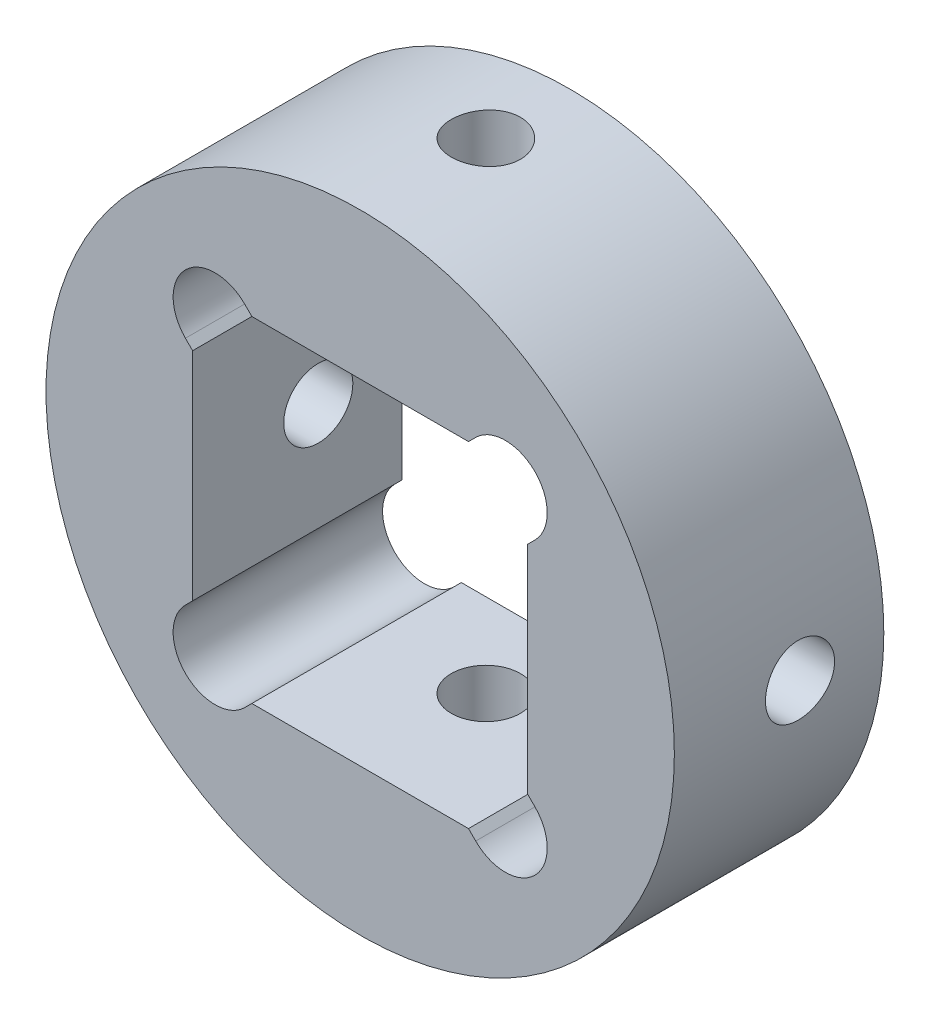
ISO-10303-21;
HEADER;
FILE_DESCRIPTION(('STEP AP214'),'2;1');
FILE_NAME('part.step','',(''),(''),'','','');
FILE_SCHEMA(('AUTOMOTIVE_DESIGN { 1 0 10303 214 1 1 1 1 }'));
ENDSEC;
DATA;
#1=APPLICATION_CONTEXT('core data for automotive mechanical design processes');
#2=APPLICATION_PROTOCOL_DEFINITION('international standard','automotive_design',2000,#1);
#3=PRODUCT_CONTEXT('',#1,'mechanical');
#4=PRODUCT('Part','Part','',(#3));
#5=PRODUCT_RELATED_PRODUCT_CATEGORY('part','',(#4));
#6=PRODUCT_DEFINITION_FORMATION('','',#4);
#7=PRODUCT_DEFINITION_CONTEXT('part definition',#1,'design');
#8=PRODUCT_DEFINITION('design','',#6,#7);
#9=PRODUCT_DEFINITION_SHAPE('','',#8);
#10=(LENGTH_UNIT() NAMED_UNIT(*) SI_UNIT(.MILLI.,.METRE.));
#11=(NAMED_UNIT(*) PLANE_ANGLE_UNIT() SI_UNIT($,.RADIAN.));
#12=(NAMED_UNIT(*) SI_UNIT($,.STERADIAN.) SOLID_ANGLE_UNIT());
#13=UNCERTAINTY_MEASURE_WITH_UNIT(LENGTH_MEASURE(1.E-05),#10,'distance_accuracy_value','');
#14=(GEOMETRIC_REPRESENTATION_CONTEXT(3) GLOBAL_UNCERTAINTY_ASSIGNED_CONTEXT((#13)) GLOBAL_UNIT_ASSIGNED_CONTEXT((#10,
#11,#12)) REPRESENTATION_CONTEXT('',''));
#15=CARTESIAN_POINT('',(0.,0.,0.));
#16=DIRECTION('',(0.,0.,1.));
#17=DIRECTION('',(1.,0.,0.));
#18=AXIS2_PLACEMENT_3D('',#15,#16,#17);
#19=CARTESIAN_POINT('',(0.,0.,6.));
#20=DIRECTION('',(0.,0.,1.));
#21=DIRECTION('',(1.,0.,0.));
#22=AXIS2_PLACEMENT_3D('',#19,#20,#21);
#23=PLANE('',#22);
#24=CARTESIAN_POINT('',(0.,0.,6.));
#25=DIRECTION('',(0.,0.,1.));
#26=DIRECTION('',(1.,0.,0.));
#27=AXIS2_PLACEMENT_3D('',#24,#25,#26);
#28=CIRCLE('',#27,15.);
#29=CARTESIAN_POINT('',(15.,0.,6.));
#30=VERTEX_POINT('',#29);
#31=EDGE_CURVE('E273',#30,#30,#28,.T.);
#32=ORIENTED_EDGE('',*,*,#31,.T.);
#33=EDGE_LOOP('',(#32));
#34=FACE_BOUND('',#33,.T.);
#35=DIRECTION('',(-0.707106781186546,-0.707106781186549,0.));
#36=VECTOR('',#35,1.);
#37=CARTESIAN_POINT('',(5.51543289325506,8.34386001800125,6.));
#38=LINE('',#37,#36);
#39=CARTESIAN_POINT('',(5.51543289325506,8.34386001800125,6.));
#40=VERTEX_POINT('',#39);
#41=CARTESIAN_POINT('',(5.17157287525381,8.,6.));
#42=VERTEX_POINT('',#41);
#43=EDGE_CURVE('E158',#40,#42,#38,.T.);
#44=ORIENTED_EDGE('',*,*,#43,.F.);
#45=CARTESIAN_POINT('',(6.92964645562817,6.92964645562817,6.));
#46=DIRECTION('',(0.,0.,1.));
#47=DIRECTION('',(1.,0.,0.));
#48=AXIS2_PLACEMENT_3D('',#45,#46,#47);
#49=CIRCLE('',#48,2.);
#50=CARTESIAN_POINT('',(8.34386001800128,5.51543289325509,6.));
#51=VERTEX_POINT('',#50);
#52=EDGE_CURVE('E150',#51,#40,#49,.T.);
#53=ORIENTED_EDGE('',*,*,#52,.F.);
#54=DIRECTION('',(0.707106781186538,0.707106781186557,0.));
#55=VECTOR('',#54,1.);
#56=CARTESIAN_POINT('',(8.34386001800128,5.51543289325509,6.));
#57=LINE('',#56,#55);
#58=CARTESIAN_POINT('',(8.,5.1715728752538,6.));
#59=VERTEX_POINT('',#58);
#60=EDGE_CURVE('E200',#59,#51,#57,.T.);
#61=ORIENTED_EDGE('',*,*,#60,.F.);
#62=DIRECTION('',(0.,1.,0.));
#63=VECTOR('',#62,1.);
#64=CARTESIAN_POINT('',(8.,5.1715728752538,6.));
#65=LINE('',#64,#63);
#66=CARTESIAN_POINT('',(7.99999999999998,-5.17157287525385,6.));
#67=VERTEX_POINT('',#66);
#68=EDGE_CURVE('E198',#67,#59,#65,.T.);
#69=ORIENTED_EDGE('',*,*,#68,.F.);
#70=DIRECTION('',(-0.707106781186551,0.707106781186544,0.));
#71=VECTOR('',#70,1.);
#72=CARTESIAN_POINT('',(8.34386001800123,-5.51543289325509,6.));
#73=LINE('',#72,#71);
#74=CARTESIAN_POINT('',(8.34386001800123,-5.51543289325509,6.));
#75=VERTEX_POINT('',#74);
#76=EDGE_CURVE('E196',#75,#67,#73,.T.);
#77=ORIENTED_EDGE('',*,*,#76,.F.);
#78=CARTESIAN_POINT('',(6.92964645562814,-6.92964645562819,6.));
#79=DIRECTION('',(0.,0.,1.));
#80=DIRECTION('',(1.,0.,0.));
#81=AXIS2_PLACEMENT_3D('',#78,#79,#80);
#82=CIRCLE('',#81,2.);
#83=CARTESIAN_POINT('',(5.51543289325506,-8.3438600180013,6.));
#84=VERTEX_POINT('',#83);
#85=EDGE_CURVE('E194',#84,#75,#82,.T.);
#86=ORIENTED_EDGE('',*,*,#85,.F.);
#87=DIRECTION('',(0.707106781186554,-0.707106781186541,0.));
#88=VECTOR('',#87,1.);
#89=CARTESIAN_POINT('',(5.51543289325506,-8.3438600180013,6.));
#90=LINE('',#89,#88);
#91=CARTESIAN_POINT('',(5.17157287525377,-8.00000000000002,6.));
#92=VERTEX_POINT('',#91);
#93=EDGE_CURVE('E192',#92,#84,#90,.T.);
#94=ORIENTED_EDGE('',*,*,#93,.F.);
#95=DIRECTION('',(1.,0.,0.));
#96=VECTOR('',#95,1.);
#97=CARTESIAN_POINT('',(-5.17157287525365,-8.,6.));
#98=LINE('',#97,#96);
#99=CARTESIAN_POINT('',(-5.17157287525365,-8.,6.));
#100=VERTEX_POINT('',#99);
#101=EDGE_CURVE('E190',#100,#92,#98,.T.);
#102=ORIENTED_EDGE('',*,*,#101,.F.);
#103=DIRECTION('',(0.707106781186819,0.707106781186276,0.));
#104=VECTOR('',#103,1.);
#105=CARTESIAN_POINT('',(-5.51543289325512,-8.34386001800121,6.));
#106=LINE('',#105,#104);
#107=CARTESIAN_POINT('',(-5.51543289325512,-8.34386001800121,6.));
#108=VERTEX_POINT('',#107);
#109=EDGE_CURVE('E188',#108,#100,#106,.T.);
#110=ORIENTED_EDGE('',*,*,#109,.F.);
#111=CARTESIAN_POINT('',(-6.92964645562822,-6.92964645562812,6.));
#112=DIRECTION('',(0.,0.,1.));
#113=DIRECTION('',(1.,0.,0.));
#114=AXIS2_PLACEMENT_3D('',#111,#112,#113);
#115=CIRCLE('',#114,2.);
#116=CARTESIAN_POINT('',(-8.34386001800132,-5.51543289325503,6.));
#117=VERTEX_POINT('',#116);
#118=EDGE_CURVE('E186',#117,#108,#115,.T.);
#119=ORIENTED_EDGE('',*,*,#118,.F.);
#120=DIRECTION('',(-0.707106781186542,-0.707106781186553,0.));
#121=VECTOR('',#120,1.);
#122=CARTESIAN_POINT('',(-8.34386001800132,-5.51543289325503,6.));
#123=LINE('',#122,#121);
#124=CARTESIAN_POINT('',(-8.00000000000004,-5.17157287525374,6.));
#125=VERTEX_POINT('',#124);
#126=EDGE_CURVE('E184',#125,#117,#123,.T.);
#127=ORIENTED_EDGE('',*,*,#126,.F.);
#128=DIRECTION('',(0.,-1.,0.));
#129=VECTOR('',#128,1.);
#130=CARTESIAN_POINT('',(-7.99999999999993,5.17157287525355,6.));
#131=LINE('',#130,#129);
#132=CARTESIAN_POINT('',(-7.99999999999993,5.17157287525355,6.));
#133=VERTEX_POINT('',#132);
#134=EDGE_CURVE('E182',#133,#125,#131,.T.);
#135=ORIENTED_EDGE('',*,*,#134,.F.);
#136=DIRECTION('',(0.707106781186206,-0.707106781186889,0.));
#137=VECTOR('',#136,1.);
#138=CARTESIAN_POINT('',(-8.3438600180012,5.51543289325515,6.));
#139=LINE('',#138,#137);
#140=CARTESIAN_POINT('',(-8.3438600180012,5.51543289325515,6.));
#141=VERTEX_POINT('',#140);
#142=EDGE_CURVE('E180',#141,#133,#139,.T.);
#143=ORIENTED_EDGE('',*,*,#142,.F.);
#144=CARTESIAN_POINT('',(-6.92964645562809,6.92964645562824,6.));
#145=DIRECTION('',(0.,0.,1.));
#146=DIRECTION('',(1.,0.,0.));
#147=AXIS2_PLACEMENT_3D('',#144,#145,#146);
#148=CIRCLE('',#147,2.);
#149=CARTESIAN_POINT('',(-5.51543289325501,8.34386001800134,6.));
#150=VERTEX_POINT('',#149);
#151=EDGE_CURVE('E178',#150,#141,#148,.T.);
#152=ORIENTED_EDGE('',*,*,#151,.F.);
#153=DIRECTION('',(-0.70710678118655,0.707106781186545,0.));
#154=VECTOR('',#153,1.);
#155=CARTESIAN_POINT('',(-5.51543289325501,8.34386001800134,6.));
#156=LINE('',#155,#154);
#157=CARTESIAN_POINT('',(-5.17157287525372,8.00000000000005,6.));
#158=VERTEX_POINT('',#157);
#159=EDGE_CURVE('E173',#158,#150,#156,.T.);
#160=ORIENTED_EDGE('',*,*,#159,.F.);
#161=DIRECTION('',(-1.,0.,0.));
#162=VECTOR('',#161,1.);
#163=CARTESIAN_POINT('',(-5.17157287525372,8.00000000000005,6.));
#164=LINE('',#163,#162);
#165=EDGE_CURVE('E171',#42,#158,#164,.T.);
#166=ORIENTED_EDGE('',*,*,#165,.F.);
#167=EDGE_LOOP('',(#44,#53,#61,#69,#77,#86,#94,#102,#110,#119,#127,#135,#143,#152,#160,#166));
#168=FACE_BOUND('',#167,.T.);
#169=ADVANCED_FACE('F33',(#34,#168),#23,.T.);
#170=CARTESIAN_POINT('',(0.,0.,-4.));
#171=DIRECTION('',(0.,0.,1.));
#172=DIRECTION('',(1.,0.,0.));
#173=AXIS2_PLACEMENT_3D('',#170,#171,#172);
#174=PLANE('',#173);
#175=CARTESIAN_POINT('',(0.,0.,-4.));
#176=DIRECTION('',(0.,0.,1.));
#177=DIRECTION('',(1.,0.,0.));
#178=AXIS2_PLACEMENT_3D('',#175,#176,#177);
#179=CIRCLE('',#178,15.);
#180=CARTESIAN_POINT('',(15.,0.,-4.));
#181=VERTEX_POINT('',#180);
#182=EDGE_CURVE('E166',#181,#181,#179,.T.);
#183=ORIENTED_EDGE('',*,*,#182,.F.);
#184=EDGE_LOOP('',(#183));
#185=FACE_BOUND('',#184,.T.);
#186=CARTESIAN_POINT('',(6.92964645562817,6.92964645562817,-4.));
#187=DIRECTION('',(0.,0.,1.));
#188=DIRECTION('',(1.,0.,0.));
#189=AXIS2_PLACEMENT_3D('',#186,#187,#188);
#190=CIRCLE('',#189,2.);
#191=CARTESIAN_POINT('',(8.34386001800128,5.51543289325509,-4.));
#192=VERTEX_POINT('',#191);
#193=CARTESIAN_POINT('',(5.51543289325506,8.34386001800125,-4.));
#194=VERTEX_POINT('',#193);
#195=EDGE_CURVE('E60',#192,#194,#190,.T.);
#196=ORIENTED_EDGE('',*,*,#195,.T.);
#197=DIRECTION('',(-0.707106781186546,-0.707106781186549,0.));
#198=VECTOR('',#197,1.);
#199=CARTESIAN_POINT('',(5.51543289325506,8.34386001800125,-4.));
#200=LINE('',#199,#198);
#201=CARTESIAN_POINT('',(5.17157287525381,8.,-4.));
#202=VERTEX_POINT('',#201);
#203=EDGE_CURVE('E165',#194,#202,#200,.T.);
#204=ORIENTED_EDGE('',*,*,#203,.T.);
#205=DIRECTION('',(-1.,0.,0.));
#206=VECTOR('',#205,1.);
#207=CARTESIAN_POINT('',(-5.17157287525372,8.00000000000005,-4.));
#208=LINE('',#207,#206);
#209=CARTESIAN_POINT('',(-5.17157287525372,8.00000000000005,-4.));
#210=VERTEX_POINT('',#209);
#211=EDGE_CURVE('E205',#202,#210,#208,.T.);
#212=ORIENTED_EDGE('',*,*,#211,.T.);
#213=DIRECTION('',(-0.70710678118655,0.707106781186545,0.));
#214=VECTOR('',#213,1.);
#215=CARTESIAN_POINT('',(-5.51543289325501,8.34386001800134,-4.));
#216=LINE('',#215,#214);
#217=CARTESIAN_POINT('',(-5.51543289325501,8.34386001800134,-4.));
#218=VERTEX_POINT('',#217);
#219=EDGE_CURVE('E208',#210,#218,#216,.T.);
#220=ORIENTED_EDGE('',*,*,#219,.T.);
#221=CARTESIAN_POINT('',(-6.92964645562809,6.92964645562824,-4.));
#222=DIRECTION('',(0.,0.,1.));
#223=DIRECTION('',(1.,0.,0.));
#224=AXIS2_PLACEMENT_3D('',#221,#222,#223);
#225=CIRCLE('',#224,2.);
#226=CARTESIAN_POINT('',(-8.3438600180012,5.51543289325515,-4.));
#227=VERTEX_POINT('',#226);
#228=EDGE_CURVE('E211',#218,#227,#225,.T.);
#229=ORIENTED_EDGE('',*,*,#228,.T.);
#230=DIRECTION('',(0.707106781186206,-0.707106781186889,0.));
#231=VECTOR('',#230,1.);
#232=CARTESIAN_POINT('',(-8.3438600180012,5.51543289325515,-4.));
#233=LINE('',#232,#231);
#234=CARTESIAN_POINT('',(-7.99999999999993,5.17157287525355,-4.));
#235=VERTEX_POINT('',#234);
#236=EDGE_CURVE('E214',#227,#235,#233,.T.);
#237=ORIENTED_EDGE('',*,*,#236,.T.);
#238=DIRECTION('',(0.,-1.,0.));
#239=VECTOR('',#238,1.);
#240=CARTESIAN_POINT('',(-7.99999999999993,5.17157287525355,-4.));
#241=LINE('',#240,#239);
#242=CARTESIAN_POINT('',(-8.00000000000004,-5.17157287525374,-4.));
#243=VERTEX_POINT('',#242);
#244=EDGE_CURVE('E217',#235,#243,#241,.T.);
#245=ORIENTED_EDGE('',*,*,#244,.T.);
#246=DIRECTION('',(-0.707106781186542,-0.707106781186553,0.));
#247=VECTOR('',#246,1.);
#248=CARTESIAN_POINT('',(-8.34386001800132,-5.51543289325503,-4.));
#249=LINE('',#248,#247);
#250=CARTESIAN_POINT('',(-8.34386001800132,-5.51543289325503,-4.));
#251=VERTEX_POINT('',#250);
#252=EDGE_CURVE('E220',#243,#251,#249,.T.);
#253=ORIENTED_EDGE('',*,*,#252,.T.);
#254=CARTESIAN_POINT('',(-6.92964645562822,-6.92964645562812,-4.));
#255=DIRECTION('',(0.,0.,1.));
#256=DIRECTION('',(1.,0.,0.));
#257=AXIS2_PLACEMENT_3D('',#254,#255,#256);
#258=CIRCLE('',#257,2.);
#259=CARTESIAN_POINT('',(-5.51543289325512,-8.34386001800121,-4.));
#260=VERTEX_POINT('',#259);
#261=EDGE_CURVE('E223',#251,#260,#258,.T.);
#262=ORIENTED_EDGE('',*,*,#261,.T.);
#263=DIRECTION('',(0.707106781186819,0.707106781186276,0.));
#264=VECTOR('',#263,1.);
#265=CARTESIAN_POINT('',(-5.51543289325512,-8.34386001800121,-4.));
#266=LINE('',#265,#264);
#267=CARTESIAN_POINT('',(-5.17157287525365,-8.,-4.));
#268=VERTEX_POINT('',#267);
#269=EDGE_CURVE('E226',#260,#268,#266,.T.);
#270=ORIENTED_EDGE('',*,*,#269,.T.);
#271=DIRECTION('',(1.,0.,0.));
#272=VECTOR('',#271,1.);
#273=CARTESIAN_POINT('',(-5.17157287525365,-8.,-4.));
#274=LINE('',#273,#272);
#275=CARTESIAN_POINT('',(5.17157287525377,-8.00000000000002,-4.));
#276=VERTEX_POINT('',#275);
#277=EDGE_CURVE('E229',#268,#276,#274,.T.);
#278=ORIENTED_EDGE('',*,*,#277,.T.);
#279=DIRECTION('',(0.707106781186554,-0.707106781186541,0.));
#280=VECTOR('',#279,1.);
#281=CARTESIAN_POINT('',(5.51543289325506,-8.3438600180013,-4.));
#282=LINE('',#281,#280);
#283=CARTESIAN_POINT('',(5.51543289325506,-8.3438600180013,-4.));
#284=VERTEX_POINT('',#283);
#285=EDGE_CURVE('E232',#276,#284,#282,.T.);
#286=ORIENTED_EDGE('',*,*,#285,.T.);
#287=CARTESIAN_POINT('',(6.92964645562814,-6.92964645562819,-4.));
#288=DIRECTION('',(0.,0.,1.));
#289=DIRECTION('',(1.,0.,0.));
#290=AXIS2_PLACEMENT_3D('',#287,#288,#289);
#291=CIRCLE('',#290,2.);
#292=CARTESIAN_POINT('',(8.34386001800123,-5.51543289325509,-4.));
#293=VERTEX_POINT('',#292);
#294=EDGE_CURVE('E235',#284,#293,#291,.T.);
#295=ORIENTED_EDGE('',*,*,#294,.T.);
#296=DIRECTION('',(-0.707106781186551,0.707106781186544,0.));
#297=VECTOR('',#296,1.);
#298=CARTESIAN_POINT('',(8.34386001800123,-5.51543289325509,-4.));
#299=LINE('',#298,#297);
#300=CARTESIAN_POINT('',(7.99999999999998,-5.17157287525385,-4.));
#301=VERTEX_POINT('',#300);
#302=EDGE_CURVE('E238',#293,#301,#299,.T.);
#303=ORIENTED_EDGE('',*,*,#302,.T.);
#304=DIRECTION('',(0.,1.,0.));
#305=VECTOR('',#304,1.);
#306=CARTESIAN_POINT('',(8.,5.1715728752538,-4.));
#307=LINE('',#306,#305);
#308=CARTESIAN_POINT('',(8.,5.1715728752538,-4.));
#309=VERTEX_POINT('',#308);
#310=EDGE_CURVE('E241',#301,#309,#307,.T.);
#311=ORIENTED_EDGE('',*,*,#310,.T.);
#312=DIRECTION('',(0.707106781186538,0.707106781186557,0.));
#313=VECTOR('',#312,1.);
#314=CARTESIAN_POINT('',(8.34386001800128,5.51543289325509,-4.));
#315=LINE('',#314,#313);
#316=EDGE_CURVE('E159',#309,#192,#315,.T.);
#317=ORIENTED_EDGE('',*,*,#316,.T.);
#318=EDGE_LOOP('',(#196,#204,#212,#220,#229,#237,#245,#253,#262,#270,#278,#286,#295,#303,#311,#317));
#319=FACE_BOUND('',#318,.T.);
#320=ADVANCED_FACE('F356',(#185,#319),#174,.F.);
#321=CARTESIAN_POINT('',(0.,0.,6.));
#322=DIRECTION('',(0.,0.,-1.));
#323=DIRECTION('',(-1.,0.,0.));
#324=AXIS2_PLACEMENT_3D('',#321,#322,#323);
#325=CYLINDRICAL_SURFACE('',#324,15.);
#326=CARTESIAN_POINT('',(15.,0.,1.64999999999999));
#327=CARTESIAN_POINT('',(14.9999988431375,0.0923818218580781,1.64999602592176));
#328=CARTESIAN_POINT('',(14.9991375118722,0.184823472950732,1.64221531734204));
#329=CARTESIAN_POINT('',(14.9957843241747,0.367140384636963,1.61129600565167));
#330=CARTESIAN_POINT('',(14.9932907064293,0.457012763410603,1.58814081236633));
#331=CARTESIAN_POINT('',(14.9869542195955,0.631524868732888,1.52715786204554));
#332=CARTESIAN_POINT('',(14.9831122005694,0.716167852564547,1.48933934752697));
#333=CARTESIAN_POINT('',(14.9745076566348,0.877887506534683,1.40012210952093));
#334=CARTESIAN_POINT('',(14.9697453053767,0.954965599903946,1.34872594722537));
#335=CARTESIAN_POINT('',(14.9598099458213,1.09971749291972,1.23357486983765));
#336=CARTESIAN_POINT('',(14.9546354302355,1.16735402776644,1.16977323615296));
#337=CARTESIAN_POINT('',(14.9444712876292,1.29098229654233,1.03172228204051));
#338=CARTESIAN_POINT('',(14.9394816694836,1.34697347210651,0.957472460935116));
#339=CARTESIAN_POINT('',(14.9302371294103,1.44585644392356,0.800395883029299));
#340=CARTESIAN_POINT('',(14.9259841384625,1.4887140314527,0.717547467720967));
#341=CARTESIAN_POINT('',(14.9187136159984,1.55989482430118,0.545775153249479));
#342=CARTESIAN_POINT('',(14.9156960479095,1.58821845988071,0.456851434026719));
#343=CARTESIAN_POINT('',(14.9112520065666,1.62941572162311,0.275835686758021));
#344=CARTESIAN_POINT('',(14.9098191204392,1.64235163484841,0.183757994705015));
#345=CARTESIAN_POINT('',(14.9086868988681,1.65259886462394,-0.00127181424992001));
#346=CARTESIAN_POINT('',(14.908987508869,1.64991067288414,-0.0942239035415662));
#347=CARTESIAN_POINT('',(14.9112824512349,1.62903725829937,-0.27793281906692));
#348=CARTESIAN_POINT('',(14.9132693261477,1.61092026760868,-0.368697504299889));
#349=CARTESIAN_POINT('',(14.9187012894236,1.55980980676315,-0.545890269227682));
#350=CARTESIAN_POINT('',(14.9221464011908,1.52681609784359,-0.632318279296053));
#351=CARTESIAN_POINT('',(14.9301152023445,1.44681419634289,-0.798598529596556));
#352=CARTESIAN_POINT('',(14.9346411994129,1.39977596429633,-0.878436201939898));
#353=CARTESIAN_POINT('',(14.944259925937,1.29304180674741,-1.02910998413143));
#354=CARTESIAN_POINT('',(14.9493526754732,1.23334543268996,-1.0999457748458));
#355=CARTESIAN_POINT('',(14.9595642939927,1.10260955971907,-1.23100135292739));
#356=CARTESIAN_POINT('',(14.9646831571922,1.03151117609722,-1.291162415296));
#357=CARTESIAN_POINT('',(14.9743446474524,0.88019332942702,-1.39870484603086));
#358=CARTESIAN_POINT('',(14.978887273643,0.799973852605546,-1.446086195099));
#359=CARTESIAN_POINT('',(14.9868864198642,0.632648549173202,-1.52672275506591));
#360=CARTESIAN_POINT('',(14.9903426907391,0.545541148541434,-1.55997472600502));
#361=CARTESIAN_POINT('',(14.9957772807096,0.3669329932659,-1.61136425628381));
#362=CARTESIAN_POINT('',(14.9977556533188,0.275432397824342,-1.62950236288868));
#363=CARTESIAN_POINT('',(15.0000046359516,0.0911434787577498,-1.65007418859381));
#364=CARTESIAN_POINT('',(15.0002840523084,-0.00163570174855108,-1.65258889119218));
#365=CARTESIAN_POINT('',(14.9991273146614,-0.186294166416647,-1.64205560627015));
#366=CARTESIAN_POINT('',(14.9976911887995,-0.278173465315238,-1.62900787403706));
#367=CARTESIAN_POINT('',(14.9932703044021,-0.458188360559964,-1.58778731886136));
#368=CARTESIAN_POINT('',(14.9902894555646,-0.546332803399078,-1.5596526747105));
#369=CARTESIAN_POINT('',(14.9831132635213,-0.716651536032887,-1.48909634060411));
#370=CARTESIAN_POINT('',(14.9789178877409,-0.798825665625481,-1.44667426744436));
#371=CARTESIAN_POINT('',(14.9697593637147,-0.955235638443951,-1.34854827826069));
#372=CARTESIAN_POINT('',(14.9647931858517,-1.02943811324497,-1.2927914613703));
#373=CARTESIAN_POINT('',(14.9546593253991,-1.16746002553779,-1.16965418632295));
#374=CARTESIAN_POINT('',(14.9494916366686,-1.23127914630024,-1.10227337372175));
#375=CARTESIAN_POINT('',(14.9395104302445,-1.34700625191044,-0.957446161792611));
#376=CARTESIAN_POINT('',(14.9346985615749,-1.39886088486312,-0.879957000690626));
#377=CARTESIAN_POINT('',(14.9259997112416,-1.48881961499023,-0.717322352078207));
#378=CARTESIAN_POINT('',(14.9221127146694,-1.52692393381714,-0.632176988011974));
#379=CARTESIAN_POINT('',(14.9157144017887,-1.58821216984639,-0.456825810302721));
#380=CARTESIAN_POINT('',(14.913200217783,-1.61142720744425,-0.366630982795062));
#381=CARTESIAN_POINT('',(14.9098235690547,-1.64237859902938,-0.183594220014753));
#382=CARTESIAN_POINT('',(14.9089610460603,-1.65011549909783,-0.0907523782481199));
#383=CARTESIAN_POINT('',(14.9089867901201,-1.64988250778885,0.0944125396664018));
#384=CARTESIAN_POINT('',(14.9098657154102,-1.64199642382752,0.186735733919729));
#385=CARTESIAN_POINT('',(14.9132553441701,-1.61091769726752,0.368736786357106));
#386=CARTESIAN_POINT('',(14.9157660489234,-1.58772504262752,0.45841464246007));
#387=CARTESIAN_POINT('',(14.9221336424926,-1.52671583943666,0.632574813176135));
#388=CARTESIAN_POINT('',(14.9259902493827,-1.48890235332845,0.717058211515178));
#389=CARTESIAN_POINT('',(14.9346156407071,-1.39973329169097,0.878493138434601));
#390=CARTESIAN_POINT('',(14.9393844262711,-1.3483776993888,0.955444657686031));
#391=CARTESIAN_POINT('',(14.9493275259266,-1.23326864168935,1.1000607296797));
#392=CARTESIAN_POINT('',(14.9545038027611,-1.16945266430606,1.16767539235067));
#393=CARTESIAN_POINT('',(14.9646609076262,-1.03136150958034,1.29127092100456));
#394=CARTESIAN_POINT('',(14.969641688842,-0.957083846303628,1.34724901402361));
#395=CARTESIAN_POINT('',(14.9788625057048,-0.799929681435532,1.44611876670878));
#396=CARTESIAN_POINT('',(14.9831002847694,-0.71702816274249,1.48897084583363));
#397=CARTESIAN_POINT('',(14.9903338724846,-0.545209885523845,1.56008722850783));
#398=CARTESIAN_POINT('',(14.993331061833,-0.456299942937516,1.58836775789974));
#399=CARTESIAN_POINT('',(14.9970040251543,-0.305751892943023,1.62259125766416));
#400=CARTESIAN_POINT('',(14.9981221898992,-0.245071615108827,1.6328552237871));
#401=CARTESIAN_POINT('',(14.9996205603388,-0.1229363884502,1.64656089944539));
#402=CARTESIAN_POINT('',(15.0000007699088,-0.0614814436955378,1.65000264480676));
#403=CARTESIAN_POINT('',(15.,0.,1.64999999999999));
#404=B_SPLINE_CURVE_WITH_KNOTS('',3,(#326,#327,#328,#329,#330,#331,#332,#333,#334,#335,#336,
#337,#338,#339,#340,#341,#342,#343,#344,#345,#346,#347,#348,#349,#350,#351,#352,#353,#354,#355,
#356,#357,#358,#359,#360,#361,#362,#363,#364,#365,#366,#367,#368,#369,#370,#371,#372,#373,#374,
#375,#376,#377,#378,#379,#380,#381,#382,#383,#384,#385,#386,#387,#388,#389,#390,#391,#392,#393,
#394,#395,#396,#397,#398,#399,#400,#401,#402,#403),.UNSPECIFIED.,.T.,.F.,(4,2,2,2,2,2,2,2,2,2,2,
2,2,2,2,2,2,2,2,2,2,2,2,2,2,2,2,2,2,2,2,2,2,2,2,2,2,2,4),(0.,0.276920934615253,
0.554141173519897,0.831186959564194,1.10818052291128,1.38623817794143,1.66430916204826,
1.94309839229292,2.22187936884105,2.49952800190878,2.77716789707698,3.05358629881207,
3.33000913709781,3.6070274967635,3.88405567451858,4.16256356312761,4.44107187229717,
4.71964401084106,4.99820606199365,5.27532298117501,5.55243535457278,5.82884975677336,
6.1052715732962,6.38280873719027,6.6603543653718,6.93911468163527,7.21787050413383,
7.49604177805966,7.77420323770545,8.05087657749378,8.3275501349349,8.60416577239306,
8.88078175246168,9.15882288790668,9.4369302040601,9.71586805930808,9.99449463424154,
10.1787905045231,10.3630854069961),.UNSPECIFIED.);
#405=CARTESIAN_POINT('',(15.,0.,1.64999999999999));
#406=VERTEX_POINT('',#405);
#407=EDGE_CURVE('E11',#406,#406,#404,.T.);
#408=ORIENTED_EDGE('',*,*,#407,.T.);
#409=EDGE_LOOP('',(#408));
#410=FACE_BOUND('',#409,.T.);
#411=CARTESIAN_POINT('',(0.,15.,-1.64999999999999));
#412=CARTESIAN_POINT('',(0.092381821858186,14.9999988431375,-1.64999602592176));
#413=CARTESIAN_POINT('',(0.18482347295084,14.9991375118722,-1.64221531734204));
#414=CARTESIAN_POINT('',(0.367140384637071,14.9957843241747,-1.61129600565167));
#415=CARTESIAN_POINT('',(0.457012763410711,14.9932907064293,-1.58814081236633));
#416=CARTESIAN_POINT('',(0.631524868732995,14.9869542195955,-1.52715786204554));
#417=CARTESIAN_POINT('',(0.716167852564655,14.9831122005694,-1.48933934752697));
#418=CARTESIAN_POINT('',(0.87788750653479,14.9745076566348,-1.40012210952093));
#419=CARTESIAN_POINT('',(0.954965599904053,14.9697453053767,-1.34872594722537));
#420=CARTESIAN_POINT('',(1.09971749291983,14.9598099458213,-1.23357486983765));
#421=CARTESIAN_POINT('',(1.16735402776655,14.9546354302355,-1.16977323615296));
#422=CARTESIAN_POINT('',(1.29098229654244,14.9444712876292,-1.03172228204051));
#423=CARTESIAN_POINT('',(1.34697347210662,14.9394816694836,-0.957472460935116));
#424=CARTESIAN_POINT('',(1.44585644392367,14.9302371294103,-0.800395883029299));
#425=CARTESIAN_POINT('',(1.48871403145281,14.9259841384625,-0.717547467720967));
#426=CARTESIAN_POINT('',(1.55989482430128,14.9187136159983,-0.545775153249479));
#427=CARTESIAN_POINT('',(1.58821845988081,14.9156960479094,-0.456851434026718));
#428=CARTESIAN_POINT('',(1.62941572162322,14.9112520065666,-0.275835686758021));
#429=CARTESIAN_POINT('',(1.64235163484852,14.9098191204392,-0.183757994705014));
#430=CARTESIAN_POINT('',(1.65259886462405,14.908686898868,0.00127181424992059));
#431=CARTESIAN_POINT('',(1.64991067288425,14.908987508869,0.0942239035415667));
#432=CARTESIAN_POINT('',(1.62903725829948,14.9112824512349,0.277932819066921));
#433=CARTESIAN_POINT('',(1.61092026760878,14.9132693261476,0.368697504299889));
#434=CARTESIAN_POINT('',(1.55980980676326,14.9187012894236,0.545890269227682));
#435=CARTESIAN_POINT('',(1.5268160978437,14.9221464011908,0.632318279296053));
#436=CARTESIAN_POINT('',(1.446814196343,14.9301152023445,0.798598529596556));
#437=CARTESIAN_POINT('',(1.39977596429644,14.9346411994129,0.878436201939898));
#438=CARTESIAN_POINT('',(1.29304180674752,14.944259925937,1.02910998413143));
#439=CARTESIAN_POINT('',(1.23334543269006,14.9493526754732,1.0999457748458));
#440=CARTESIAN_POINT('',(1.10260955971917,14.9595642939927,1.23100135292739));
#441=CARTESIAN_POINT('',(1.03151117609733,14.9646831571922,1.291162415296));
#442=CARTESIAN_POINT('',(0.880193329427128,14.9743446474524,1.39870484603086));
#443=CARTESIAN_POINT('',(0.799973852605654,14.978887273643,1.446086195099));
#444=CARTESIAN_POINT('',(0.63264854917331,14.9868864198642,1.52672275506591));
#445=CARTESIAN_POINT('',(0.545541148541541,14.9903426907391,1.55997472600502));
#446=CARTESIAN_POINT('',(0.366932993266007,14.9957772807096,1.61136425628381));
#447=CARTESIAN_POINT('',(0.275432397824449,14.9977556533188,1.62950236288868));
#448=CARTESIAN_POINT('',(0.0911434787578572,15.0000046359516,1.65007418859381));
#449=CARTESIAN_POINT('',(-0.00163570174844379,15.0002840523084,1.65258889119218));
#450=CARTESIAN_POINT('',(-0.186294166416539,14.9991273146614,1.64205560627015));
#451=CARTESIAN_POINT('',(-0.27817346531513,14.9976911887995,1.62900787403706));
#452=CARTESIAN_POINT('',(-0.458188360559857,14.9932703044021,1.58778731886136));
#453=CARTESIAN_POINT('',(-0.54633280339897,14.9902894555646,1.5596526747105));
#454=CARTESIAN_POINT('',(-0.71665153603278,14.9831132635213,1.48909634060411));
#455=CARTESIAN_POINT('',(-0.798825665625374,14.9789178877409,1.44667426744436));
#456=CARTESIAN_POINT('',(-0.955235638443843,14.9697593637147,1.34854827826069));
#457=CARTESIAN_POINT('',(-1.02943811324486,14.9647931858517,1.2927914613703));
#458=CARTESIAN_POINT('',(-1.16746002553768,14.9546593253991,1.16965418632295));
#459=CARTESIAN_POINT('',(-1.23127914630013,14.9494916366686,1.10227337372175));
#460=CARTESIAN_POINT('',(-1.34700625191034,14.9395104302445,0.95744616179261));
#461=CARTESIAN_POINT('',(-1.39886088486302,14.9346985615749,0.879957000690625));
#462=CARTESIAN_POINT('',(-1.48881961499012,14.9259997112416,0.717322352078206));
#463=CARTESIAN_POINT('',(-1.52692393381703,14.9221127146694,0.632176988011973));
#464=CARTESIAN_POINT('',(-1.58821216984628,14.9157144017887,0.456825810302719));
#465=CARTESIAN_POINT('',(-1.61142720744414,14.913200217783,0.366630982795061));
#466=CARTESIAN_POINT('',(-1.64237859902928,14.9098235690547,0.183594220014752));
#467=CARTESIAN_POINT('',(-1.65011549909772,14.9089610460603,0.0907523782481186));
#468=CARTESIAN_POINT('',(-1.64988250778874,14.9089867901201,-0.094412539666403));
#469=CARTESIAN_POINT('',(-1.64199642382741,14.9098657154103,-0.18673573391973));
#470=CARTESIAN_POINT('',(-1.61091769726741,14.9132553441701,-0.368736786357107));
#471=CARTESIAN_POINT('',(-1.58772504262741,14.9157660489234,-0.458414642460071));
#472=CARTESIAN_POINT('',(-1.52671583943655,14.9221336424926,-0.632574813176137));
#473=CARTESIAN_POINT('',(-1.48890235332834,14.9259902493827,-0.71705821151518));
#474=CARTESIAN_POINT('',(-1.39973329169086,14.9346156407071,-0.878493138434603));
#475=CARTESIAN_POINT('',(-1.34837769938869,14.9393844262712,-0.955444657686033));
#476=CARTESIAN_POINT('',(-1.23326864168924,14.9493275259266,-1.1000607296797));
#477=CARTESIAN_POINT('',(-1.16945266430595,14.9545038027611,-1.16767539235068));
#478=CARTESIAN_POINT('',(-1.03136150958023,14.9646609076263,-1.29127092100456));
#479=CARTESIAN_POINT('',(-0.957083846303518,14.969641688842,-1.34724901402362));
#480=CARTESIAN_POINT('',(-0.799929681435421,14.9788625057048,-1.44611876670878));
#481=CARTESIAN_POINT('',(-0.71702816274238,14.9831002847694,-1.48897084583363));
#482=CARTESIAN_POINT('',(-0.545209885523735,14.9903338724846,-1.56008722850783));
#483=CARTESIAN_POINT('',(-0.456299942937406,14.993331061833,-1.58836775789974));
#484=CARTESIAN_POINT('',(-0.305751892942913,14.9970040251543,-1.62259125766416));
#485=CARTESIAN_POINT('',(-0.245071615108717,14.9981221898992,-1.6328552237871));
#486=CARTESIAN_POINT('',(-0.122936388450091,14.9996205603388,-1.64656089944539));
#487=CARTESIAN_POINT('',(-0.0614814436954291,15.0000007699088,-1.65000264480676));
#488=CARTESIAN_POINT('',(0.,15.,-1.64999999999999));
#489=B_SPLINE_CURVE_WITH_KNOTS('',3,(#411,#412,#413,#414,#415,#416,#417,#418,#419,#420,#421,
#422,#423,#424,#425,#426,#427,#428,#429,#430,#431,#432,#433,#434,#435,#436,#437,#438,#439,#440,
#441,#442,#443,#444,#445,#446,#447,#448,#449,#450,#451,#452,#453,#454,#455,#456,#457,#458,#459,
#460,#461,#462,#463,#464,#465,#466,#467,#468,#469,#470,#471,#472,#473,#474,#475,#476,#477,#478,
#479,#480,#481,#482,#483,#484,#485,#486,#487,#488),.UNSPECIFIED.,.T.,.F.,(4,2,2,2,2,2,2,2,2,2,2,
2,2,2,2,2,2,2,2,2,2,2,2,2,2,2,2,2,2,2,2,2,2,2,2,2,2,2,4),(0.,0.276920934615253,
0.554141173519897,0.831186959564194,1.10818052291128,1.38623817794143,1.66430916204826,
1.94309839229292,2.22187936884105,2.49952800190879,2.77716789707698,3.05358629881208,
3.33000913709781,3.6070274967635,3.88405567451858,4.16256356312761,4.44107187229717,
4.71964401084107,4.99820606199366,5.27532298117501,5.55243535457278,5.82884975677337,
6.10527157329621,6.38280873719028,6.6603543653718,6.93911468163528,7.21787050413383,
7.49604177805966,7.77420323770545,8.05087657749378,8.3275501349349,8.60416577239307,
8.88078175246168,9.15882288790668,9.4369302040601,9.71586805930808,9.99449463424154,
10.1787905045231,10.3630854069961),.UNSPECIFIED.);
#490=CARTESIAN_POINT('',(0.,15.,-1.64999999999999));
#491=VERTEX_POINT('',#490);
#492=EDGE_CURVE('E45',#491,#491,#489,.T.);
#493=ORIENTED_EDGE('',*,*,#492,.T.);
#494=EDGE_LOOP('',(#493));
#495=FACE_BOUND('',#494,.T.);
#496=CARTESIAN_POINT('',(-15.,0.,-1.64999999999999));
#497=CARTESIAN_POINT('',(-14.9999988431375,0.0923818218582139,-1.64999602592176));
#498=CARTESIAN_POINT('',(-14.9991375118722,0.184823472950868,-1.64221531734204));
#499=CARTESIAN_POINT('',(-14.9957843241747,0.367140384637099,-1.61129600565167));
#500=CARTESIAN_POINT('',(-14.9932907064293,0.457012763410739,-1.58814081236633));
#501=CARTESIAN_POINT('',(-14.9869542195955,0.631524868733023,-1.52715786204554));
#502=CARTESIAN_POINT('',(-14.9831122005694,0.716167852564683,-1.48933934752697));
#503=CARTESIAN_POINT('',(-14.9745076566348,0.877887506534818,-1.40012210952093));
#504=CARTESIAN_POINT('',(-14.9697453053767,0.954965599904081,-1.34872594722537));
#505=CARTESIAN_POINT('',(-14.9598099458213,1.09971749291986,-1.23357486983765));
#506=CARTESIAN_POINT('',(-14.9546354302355,1.16735402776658,-1.16977323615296));
#507=CARTESIAN_POINT('',(-14.9444712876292,1.29098229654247,-1.03172228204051));
#508=CARTESIAN_POINT('',(-14.9394816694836,1.34697347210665,-0.957472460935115));
#509=CARTESIAN_POINT('',(-14.9302371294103,1.4458564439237,-0.800395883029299));
#510=CARTESIAN_POINT('',(-14.9259841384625,1.48871403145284,-0.717547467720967));
#511=CARTESIAN_POINT('',(-14.9187136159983,1.55989482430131,-0.545775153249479));
#512=CARTESIAN_POINT('',(-14.9156960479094,1.58821845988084,-0.456851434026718));
#513=CARTESIAN_POINT('',(-14.9112520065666,1.62941572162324,-0.275835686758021));
#514=CARTESIAN_POINT('',(-14.9098191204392,1.64235163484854,-0.183757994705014));
#515=CARTESIAN_POINT('',(-14.908686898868,1.65259886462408,0.00127181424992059));
#516=CARTESIAN_POINT('',(-14.908987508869,1.64991067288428,0.0942239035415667));
#517=CARTESIAN_POINT('',(-14.9112824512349,1.62903725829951,0.277932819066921));
#518=CARTESIAN_POINT('',(-14.9132693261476,1.61092026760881,0.368697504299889));
#519=CARTESIAN_POINT('',(-14.9187012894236,1.55980980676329,0.545890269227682));
#520=CARTESIAN_POINT('',(-14.9221464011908,1.52681609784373,0.632318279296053));
#521=CARTESIAN_POINT('',(-14.9301152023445,1.44681419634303,0.798598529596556));
#522=CARTESIAN_POINT('',(-14.9346411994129,1.39977596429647,0.878436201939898));
#523=CARTESIAN_POINT('',(-14.944259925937,1.29304180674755,1.02910998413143));
#524=CARTESIAN_POINT('',(-14.9493526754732,1.23334543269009,1.0999457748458));
#525=CARTESIAN_POINT('',(-14.9595642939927,1.1026095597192,1.23100135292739));
#526=CARTESIAN_POINT('',(-14.9646831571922,1.03151117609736,1.291162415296));
#527=CARTESIAN_POINT('',(-14.9743446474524,0.880193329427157,1.39870484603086));
#528=CARTESIAN_POINT('',(-14.978887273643,0.799973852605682,1.446086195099));
#529=CARTESIAN_POINT('',(-14.9868864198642,0.632648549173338,1.52672275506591));
#530=CARTESIAN_POINT('',(-14.9903426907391,0.54554114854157,1.55997472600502));
#531=CARTESIAN_POINT('',(-14.9957772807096,0.366932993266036,1.61136425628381));
#532=CARTESIAN_POINT('',(-14.9977556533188,0.275432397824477,1.62950236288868));
#533=CARTESIAN_POINT('',(-15.0000046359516,0.0911434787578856,1.65007418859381));
#534=CARTESIAN_POINT('',(-15.0002840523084,-0.00163570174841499,1.65258889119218));
#535=CARTESIAN_POINT('',(-14.9991273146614,-0.186294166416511,1.64205560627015));
#536=CARTESIAN_POINT('',(-14.9976911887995,-0.278173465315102,1.62900787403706));
#537=CARTESIAN_POINT('',(-14.9932703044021,-0.458188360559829,1.58778731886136));
#538=CARTESIAN_POINT('',(-14.9902894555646,-0.546332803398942,1.5596526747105));
#539=CARTESIAN_POINT('',(-14.9831132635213,-0.716651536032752,1.48909634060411));
#540=CARTESIAN_POINT('',(-14.9789178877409,-0.798825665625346,1.44667426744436));
#541=CARTESIAN_POINT('',(-14.9697593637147,-0.955235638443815,1.34854827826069));
#542=CARTESIAN_POINT('',(-14.9647931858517,-1.02943811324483,1.2927914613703));
#543=CARTESIAN_POINT('',(-14.9546593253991,-1.16746002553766,1.16965418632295));
#544=CARTESIAN_POINT('',(-14.9494916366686,-1.2312791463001,1.10227337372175));
#545=CARTESIAN_POINT('',(-14.9395104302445,-1.34700625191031,0.95744616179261));
#546=CARTESIAN_POINT('',(-14.9346985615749,-1.39886088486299,0.879957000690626));
#547=CARTESIAN_POINT('',(-14.9259997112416,-1.48881961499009,0.717322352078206));
#548=CARTESIAN_POINT('',(-14.9221127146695,-1.52692393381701,0.632176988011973));
#549=CARTESIAN_POINT('',(-14.9157144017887,-1.58821216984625,0.45682581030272));
#550=CARTESIAN_POINT('',(-14.913200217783,-1.61142720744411,0.366630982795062));
#551=CARTESIAN_POINT('',(-14.9098235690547,-1.64237859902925,0.183594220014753));
#552=CARTESIAN_POINT('',(-14.9089610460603,-1.6501154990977,0.0907523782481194));
#553=CARTESIAN_POINT('',(-14.9089867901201,-1.64988250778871,-0.0944125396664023));
#554=CARTESIAN_POINT('',(-14.9098657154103,-1.64199642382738,-0.18673573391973));
#555=CARTESIAN_POINT('',(-14.9132553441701,-1.61091769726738,-0.368736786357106));
#556=CARTESIAN_POINT('',(-14.9157660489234,-1.58772504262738,-0.458414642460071));
#557=CARTESIAN_POINT('',(-14.9221336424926,-1.52671583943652,-0.632574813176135));
#558=CARTESIAN_POINT('',(-14.9259902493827,-1.48890235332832,-0.717058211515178));
#559=CARTESIAN_POINT('',(-14.9346156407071,-1.39973329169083,-0.878493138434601));
#560=CARTESIAN_POINT('',(-14.9393844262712,-1.34837769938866,-0.955444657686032));
#561=CARTESIAN_POINT('',(-14.9493275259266,-1.23326864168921,-1.1000607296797));
#562=CARTESIAN_POINT('',(-14.9545038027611,-1.16945266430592,-1.16767539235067));
#563=CARTESIAN_POINT('',(-14.9646609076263,-1.03136150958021,-1.29127092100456));
#564=CARTESIAN_POINT('',(-14.969641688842,-0.95708384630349,-1.34724901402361));
#565=CARTESIAN_POINT('',(-14.9788625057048,-0.799929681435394,-1.44611876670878));
#566=CARTESIAN_POINT('',(-14.9831002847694,-0.717028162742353,-1.48897084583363));
#567=CARTESIAN_POINT('',(-14.9903338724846,-0.545209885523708,-1.56008722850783));
#568=CARTESIAN_POINT('',(-14.993331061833,-0.456299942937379,-1.58836775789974));
#569=CARTESIAN_POINT('',(-14.9970040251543,-0.305751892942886,-1.62259125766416));
#570=CARTESIAN_POINT('',(-14.9981221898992,-0.245071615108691,-1.6328552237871));
#571=CARTESIAN_POINT('',(-14.9996205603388,-0.122936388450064,-1.64656089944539));
#572=CARTESIAN_POINT('',(-15.0000007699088,-0.0614814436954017,-1.65000264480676));
#573=CARTESIAN_POINT('',(-15.,0.,-1.64999999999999));
#574=B_SPLINE_CURVE_WITH_KNOTS('',3,(#496,#497,#498,#499,#500,#501,#502,#503,#504,#505,#506,
#507,#508,#509,#510,#511,#512,#513,#514,#515,#516,#517,#518,#519,#520,#521,#522,#523,#524,#525,
#526,#527,#528,#529,#530,#531,#532,#533,#534,#535,#536,#537,#538,#539,#540,#541,#542,#543,#544,
#545,#546,#547,#548,#549,#550,#551,#552,#553,#554,#555,#556,#557,#558,#559,#560,#561,#562,#563,
#564,#565,#566,#567,#568,#569,#570,#571,#572,#573),.UNSPECIFIED.,.T.,.F.,(4,2,2,2,2,2,2,2,2,2,2,
2,2,2,2,2,2,2,2,2,2,2,2,2,2,2,2,2,2,2,2,2,2,2,2,2,2,2,4),(0.,0.276920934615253,
0.554141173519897,0.831186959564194,1.10818052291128,1.38623817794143,1.66430916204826,
1.94309839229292,2.22187936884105,2.49952800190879,2.77716789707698,3.05358629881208,
3.33000913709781,3.6070274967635,3.88405567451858,4.16256356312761,4.44107187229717,
4.71964401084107,4.99820606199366,5.27532298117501,5.55243535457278,5.82884975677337,
6.10527157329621,6.38280873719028,6.6603543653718,6.93911468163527,7.21787050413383,
7.49604177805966,7.77420323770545,8.05087657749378,8.3275501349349,8.60416577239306,
8.88078175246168,9.15882288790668,9.4369302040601,9.71586805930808,9.99449463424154,
10.1787905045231,10.3630854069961),.UNSPECIFIED.);
#575=CARTESIAN_POINT('',(-15.,0.,-1.64999999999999));
#576=VERTEX_POINT('',#575);
#577=EDGE_CURVE('E284',#576,#576,#574,.T.);
#578=ORIENTED_EDGE('',*,*,#577,.T.);
#579=EDGE_LOOP('',(#578));
#580=FACE_BOUND('',#579,.T.);
#581=CARTESIAN_POINT('',(0.,-15.,1.64999999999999));
#582=CARTESIAN_POINT('',(0.0923818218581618,-14.9999988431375,1.64999602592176));
#583=CARTESIAN_POINT('',(0.184823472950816,-14.9991375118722,1.64221531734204));
#584=CARTESIAN_POINT('',(0.367140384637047,-14.9957843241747,1.61129600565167));
#585=CARTESIAN_POINT('',(0.457012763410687,-14.9932907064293,1.58814081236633));
#586=CARTESIAN_POINT('',(0.631524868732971,-14.9869542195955,1.52715786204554));
#587=CARTESIAN_POINT('',(0.716167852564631,-14.9831122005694,1.48933934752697));
#588=CARTESIAN_POINT('',(0.877887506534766,-14.9745076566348,1.40012210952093));
#589=CARTESIAN_POINT('',(0.954965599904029,-14.9697453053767,1.34872594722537));
#590=CARTESIAN_POINT('',(1.0997174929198,-14.9598099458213,1.23357486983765));
#591=CARTESIAN_POINT('',(1.16735402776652,-14.9546354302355,1.16977323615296));
#592=CARTESIAN_POINT('',(1.29098229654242,-14.9444712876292,1.03172228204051));
#593=CARTESIAN_POINT('',(1.3469734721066,-14.9394816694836,0.957472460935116));
#594=CARTESIAN_POINT('',(1.44585644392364,-14.9302371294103,0.800395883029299));
#595=CARTESIAN_POINT('',(1.48871403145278,-14.9259841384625,0.717547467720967));
#596=CARTESIAN_POINT('',(1.55989482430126,-14.9187136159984,0.545775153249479));
#597=CARTESIAN_POINT('',(1.58821845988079,-14.9156960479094,0.456851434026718));
#598=CARTESIAN_POINT('',(1.62941572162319,-14.9112520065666,0.27583568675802));
#599=CARTESIAN_POINT('',(1.64235163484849,-14.9098191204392,0.183757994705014));
#600=CARTESIAN_POINT('',(1.65259886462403,-14.908686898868,-0.0012718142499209));
#601=CARTESIAN_POINT('',(1.64991067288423,-14.908987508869,-0.094223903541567));
#602=CARTESIAN_POINT('',(1.62903725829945,-14.9112824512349,-0.277932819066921));
#603=CARTESIAN_POINT('',(1.61092026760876,-14.9132693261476,-0.368697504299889));
#604=CARTESIAN_POINT('',(1.55980980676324,-14.9187012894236,-0.545890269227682));
#605=CARTESIAN_POINT('',(1.52681609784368,-14.9221464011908,-0.632318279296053));
#606=CARTESIAN_POINT('',(1.44681419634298,-14.9301152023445,-0.798598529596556));
#607=CARTESIAN_POINT('',(1.39977596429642,-14.9346411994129,-0.878436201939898));
#608=CARTESIAN_POINT('',(1.2930418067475,-14.944259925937,-1.02910998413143));
#609=CARTESIAN_POINT('',(1.23334543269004,-14.9493526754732,-1.0999457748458));
#610=CARTESIAN_POINT('',(1.10260955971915,-14.9595642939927,-1.23100135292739));
#611=CARTESIAN_POINT('',(1.03151117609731,-14.9646831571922,-1.291162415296));
#612=CARTESIAN_POINT('',(0.880193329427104,-14.9743446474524,-1.39870484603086));
#613=CARTESIAN_POINT('',(0.79997385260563,-14.978887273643,-1.446086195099));
#614=CARTESIAN_POINT('',(0.632648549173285,-14.9868864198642,-1.52672275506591));
#615=CARTESIAN_POINT('',(0.545541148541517,-14.9903426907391,-1.55997472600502));
#616=CARTESIAN_POINT('',(0.366932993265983,-14.9957772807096,-1.61136425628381));
#617=CARTESIAN_POINT('',(0.275432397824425,-14.9977556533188,-1.62950236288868));
#618=CARTESIAN_POINT('',(0.0911434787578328,-15.0000046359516,-1.65007418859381));
#619=CARTESIAN_POINT('',(-0.00163570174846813,-15.0002840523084,-1.65258889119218));
#620=CARTESIAN_POINT('',(-0.186294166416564,-14.9991273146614,-1.64205560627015));
#621=CARTESIAN_POINT('',(-0.278173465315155,-14.9976911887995,-1.62900787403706));
#622=CARTESIAN_POINT('',(-0.458188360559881,-14.9932703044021,-1.58778731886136));
#623=CARTESIAN_POINT('',(-0.546332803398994,-14.9902894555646,-1.5596526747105));
#624=CARTESIAN_POINT('',(-0.716651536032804,-14.9831132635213,-1.48909634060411));
#625=CARTESIAN_POINT('',(-0.798825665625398,-14.9789178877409,-1.44667426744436));
#626=CARTESIAN_POINT('',(-0.955235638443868,-14.9697593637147,-1.34854827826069));
#627=CARTESIAN_POINT('',(-1.02943811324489,-14.9647931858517,-1.2927914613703));
#628=CARTESIAN_POINT('',(-1.16746002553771,-14.9546593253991,-1.16965418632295));
#629=CARTESIAN_POINT('',(-1.23127914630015,-14.9494916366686,-1.10227337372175));
#630=CARTESIAN_POINT('',(-1.34700625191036,-14.9395104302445,-0.95744616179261));
#631=CARTESIAN_POINT('',(-1.39886088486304,-14.9346985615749,-0.879957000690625));
#632=CARTESIAN_POINT('',(-1.48881961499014,-14.9259997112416,-0.717322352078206));
#633=CARTESIAN_POINT('',(-1.52692393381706,-14.9221127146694,-0.632176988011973));
#634=CARTESIAN_POINT('',(-1.5882121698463,-14.9157144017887,-0.45682581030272));
#635=CARTESIAN_POINT('',(-1.61142720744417,-14.913200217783,-0.366630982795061));
#636=CARTESIAN_POINT('',(-1.6423785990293,-14.9098235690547,-0.183594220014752));
#637=CARTESIAN_POINT('',(-1.65011549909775,-14.9089610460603,-0.0907523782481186));
#638=CARTESIAN_POINT('',(-1.64988250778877,-14.9089867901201,0.0944125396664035));
#639=CARTESIAN_POINT('',(-1.64199642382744,-14.9098657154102,0.186735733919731));
#640=CARTESIAN_POINT('',(-1.61091769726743,-14.9132553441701,0.368736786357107));
#641=CARTESIAN_POINT('',(-1.58772504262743,-14.9157660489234,0.458414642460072));
#642=CARTESIAN_POINT('',(-1.52671583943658,-14.9221336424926,0.632574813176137));
#643=CARTESIAN_POINT('',(-1.48890235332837,-14.9259902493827,0.71705821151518));
#644=CARTESIAN_POINT('',(-1.39973329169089,-14.9346156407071,0.878493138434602));
#645=CARTESIAN_POINT('',(-1.34837769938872,-14.9393844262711,0.955444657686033));
#646=CARTESIAN_POINT('',(-1.23326864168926,-14.9493275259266,1.1000607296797));
#647=CARTESIAN_POINT('',(-1.16945266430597,-14.9545038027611,1.16767539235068));
#648=CARTESIAN_POINT('',(-1.03136150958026,-14.9646609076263,1.29127092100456));
#649=CARTESIAN_POINT('',(-0.957083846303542,-14.969641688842,1.34724901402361));
#650=CARTESIAN_POINT('',(-0.799929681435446,-14.9788625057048,1.44611876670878));
#651=CARTESIAN_POINT('',(-0.717028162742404,-14.9831002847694,1.48897084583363));
#652=CARTESIAN_POINT('',(-0.545209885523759,-14.9903338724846,1.56008722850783));
#653=CARTESIAN_POINT('',(-0.45629994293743,-14.993331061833,1.58836775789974));
#654=CARTESIAN_POINT('',(-0.305751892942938,-14.9970040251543,1.62259125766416));
#655=CARTESIAN_POINT('',(-0.245071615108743,-14.9981221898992,1.6328552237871));
#656=CARTESIAN_POINT('',(-0.122936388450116,-14.9996205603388,1.64656089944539));
#657=CARTESIAN_POINT('',(-0.0614814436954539,-15.0000007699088,1.65000264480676));
#658=CARTESIAN_POINT('',(0.,-15.,1.64999999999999));
#659=B_SPLINE_CURVE_WITH_KNOTS('',3,(#581,#582,#583,#584,#585,#586,#587,#588,#589,#590,#591,
#592,#593,#594,#595,#596,#597,#598,#599,#600,#601,#602,#603,#604,#605,#606,#607,#608,#609,#610,
#611,#612,#613,#614,#615,#616,#617,#618,#619,#620,#621,#622,#623,#624,#625,#626,#627,#628,#629,
#630,#631,#632,#633,#634,#635,#636,#637,#638,#639,#640,#641,#642,#643,#644,#645,#646,#647,#648,
#649,#650,#651,#652,#653,#654,#655,#656,#657,#658),.UNSPECIFIED.,.T.,.F.,(4,2,2,2,2,2,2,2,2,2,2,
2,2,2,2,2,2,2,2,2,2,2,2,2,2,2,2,2,2,2,2,2,2,2,2,2,2,2,4),(0.,0.276920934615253,
0.554141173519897,0.831186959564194,1.10818052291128,1.38623817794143,1.66430916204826,
1.94309839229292,2.22187936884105,2.49952800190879,2.77716789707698,3.05358629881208,
3.33000913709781,3.6070274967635,3.88405567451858,4.16256356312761,4.44107187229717,
4.71964401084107,4.99820606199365,5.27532298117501,5.55243535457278,5.82884975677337,
6.10527157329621,6.38280873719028,6.6603543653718,6.93911468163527,7.21787050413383,
7.49604177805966,7.77420323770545,8.05087657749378,8.3275501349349,8.60416577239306,
8.88078175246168,9.15882288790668,9.4369302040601,9.71586805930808,9.99449463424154,
10.1787905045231,10.3630854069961),.UNSPECIFIED.);
#660=CARTESIAN_POINT('',(0.,-15.,1.64999999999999));
#661=VERTEX_POINT('',#660);
#662=EDGE_CURVE('E276',#661,#661,#659,.T.);
#663=ORIENTED_EDGE('',*,*,#662,.T.);
#664=EDGE_LOOP('',(#663));
#665=FACE_BOUND('',#664,.T.);
#666=ORIENTED_EDGE('',*,*,#31,.F.);
#667=EDGE_LOOP('',(#666));
#668=FACE_BOUND('',#667,.T.);
#669=ORIENTED_EDGE('',*,*,#182,.T.);
#670=EDGE_LOOP('',(#669));
#671=FACE_BOUND('',#670,.T.);
#672=ADVANCED_FACE('F35',(#410,#495,#580,#665,#668,#671),#325,.T.);
#673=CARTESIAN_POINT('',(6.92964645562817,6.92964645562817,6.));
#674=DIRECTION('',(0.,0.,-1.));
#675=DIRECTION('',(-1.,0.,0.));
#676=AXIS2_PLACEMENT_3D('',#673,#674,#675);
#677=CYLINDRICAL_SURFACE('',#676,2.);
#678=ORIENTED_EDGE('',*,*,#195,.F.);
#679=DIRECTION('',(0.,0.,-1.));
#680=VECTOR('',#679,1.);
#681=CARTESIAN_POINT('',(8.34386001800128,5.51543289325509,6.));
#682=LINE('',#681,#680);
#683=EDGE_CURVE('E154',#51,#192,#682,.T.);
#684=ORIENTED_EDGE('',*,*,#683,.F.);
#685=ORIENTED_EDGE('',*,*,#52,.T.);
#686=DIRECTION('',(0.,0.,-1.));
#687=VECTOR('',#686,1.);
#688=CARTESIAN_POINT('',(5.51543289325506,8.34386001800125,6.));
#689=LINE('',#688,#687);
#690=EDGE_CURVE('E153',#40,#194,#689,.T.);
#691=ORIENTED_EDGE('',*,*,#690,.T.);
#692=EDGE_LOOP('',(#678,#684,#685,#691));
#693=FACE_BOUND('',#692,.T.);
#694=ADVANCED_FACE('F152',(#693),#677,.F.);
#695=CARTESIAN_POINT('',(5.51543289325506,8.34386001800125,6.));
#696=DIRECTION('',(0.707106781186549,-0.707106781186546,0.));
#697=DIRECTION('',(0.707106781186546,0.707106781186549,0.));
#698=AXIS2_PLACEMENT_3D('',#695,#696,#697);
#699=PLANE('',#698);
#700=ORIENTED_EDGE('',*,*,#203,.F.);
#701=ORIENTED_EDGE('',*,*,#690,.F.);
#702=ORIENTED_EDGE('',*,*,#43,.T.);
#703=DIRECTION('',(0.,0.,-1.));
#704=VECTOR('',#703,1.);
#705=CARTESIAN_POINT('',(5.17157287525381,8.,6.));
#706=LINE('',#705,#704);
#707=EDGE_CURVE('E167',#42,#202,#706,.T.);
#708=ORIENTED_EDGE('',*,*,#707,.T.);
#709=EDGE_LOOP('',(#700,#701,#702,#708));
#710=FACE_BOUND('',#709,.T.);
#711=ADVANCED_FACE('F162',(#710),#699,.T.);
#712=CARTESIAN_POINT('',(-5.17157287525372,8.00000000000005,6.));
#713=DIRECTION('',(0.,-1.,0.));
#714=DIRECTION('',(1.,0.,0.));
#715=AXIS2_PLACEMENT_3D('',#712,#713,#714);
#716=PLANE('',#715);
#717=CARTESIAN_POINT('',(0.,8.00000000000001,0.));
#718=DIRECTION('',(0.,-1.,0.));
#719=DIRECTION('',(0.,0.,-1.));
#720=AXIS2_PLACEMENT_3D('',#717,#718,#719);
#721=CIRCLE('',#720,1.64999999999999);
#722=CARTESIAN_POINT('',(0.,8.00000000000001,-1.64999999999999));
#723=VERTEX_POINT('',#722);
#724=EDGE_CURVE('E438',#723,#723,#721,.T.);
#725=ORIENTED_EDGE('',*,*,#724,.F.);
#726=EDGE_LOOP('',(#725));
#727=FACE_BOUND('',#726,.T.);
#728=ORIENTED_EDGE('',*,*,#211,.F.);
#729=ORIENTED_EDGE('',*,*,#707,.F.);
#730=ORIENTED_EDGE('',*,*,#165,.T.);
#731=DIRECTION('',(0.,0.,-1.));
#732=VECTOR('',#731,1.);
#733=CARTESIAN_POINT('',(-5.17157287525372,8.00000000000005,6.));
#734=LINE('',#733,#732);
#735=EDGE_CURVE('E270',#158,#210,#734,.T.);
#736=ORIENTED_EDGE('',*,*,#735,.T.);
#737=EDGE_LOOP('',(#728,#729,#730,#736));
#738=FACE_BOUND('',#737,.T.);
#739=ADVANCED_FACE('F346',(#727,#738),#716,.T.);
#740=CARTESIAN_POINT('',(-5.51543289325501,8.34386001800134,6.));
#741=DIRECTION('',(-0.707106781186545,-0.70710678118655,0.));
#742=DIRECTION('',(0.70710678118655,-0.707106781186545,0.));
#743=AXIS2_PLACEMENT_3D('',#740,#741,#742);
#744=PLANE('',#743);
#745=ORIENTED_EDGE('',*,*,#219,.F.);
#746=ORIENTED_EDGE('',*,*,#735,.F.);
#747=ORIENTED_EDGE('',*,*,#159,.T.);
#748=DIRECTION('',(0.,0.,-1.));
#749=VECTOR('',#748,1.);
#750=CARTESIAN_POINT('',(-5.51543289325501,8.34386001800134,6.));
#751=LINE('',#750,#749);
#752=EDGE_CURVE('E268',#150,#218,#751,.T.);
#753=ORIENTED_EDGE('',*,*,#752,.T.);
#754=EDGE_LOOP('',(#745,#746,#747,#753));
#755=FACE_BOUND('',#754,.T.);
#756=ADVANCED_FACE('F342',(#755),#744,.T.);
#757=CARTESIAN_POINT('',(-6.92964645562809,6.92964645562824,6.));
#758=DIRECTION('',(0.,0.,-1.));
#759=DIRECTION('',(-1.,0.,0.));
#760=AXIS2_PLACEMENT_3D('',#757,#758,#759);
#761=CYLINDRICAL_SURFACE('',#760,2.);
#762=ORIENTED_EDGE('',*,*,#228,.F.);
#763=ORIENTED_EDGE('',*,*,#752,.F.);
#764=ORIENTED_EDGE('',*,*,#151,.T.);
#765=DIRECTION('',(0.,0.,-1.));
#766=VECTOR('',#765,1.);
#767=CARTESIAN_POINT('',(-8.3438600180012,5.51543289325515,6.));
#768=LINE('',#767,#766);
#769=EDGE_CURVE('E266',#141,#227,#768,.T.);
#770=ORIENTED_EDGE('',*,*,#769,.T.);
#771=EDGE_LOOP('',(#762,#763,#764,#770));
#772=FACE_BOUND('',#771,.T.);
#773=ADVANCED_FACE('F338',(#772),#761,.F.);
#774=CARTESIAN_POINT('',(-8.3438600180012,5.51543289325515,6.));
#775=DIRECTION('',(0.707106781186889,0.707106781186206,0.));
#776=DIRECTION('',(-0.707106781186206,0.707106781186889,0.));
#777=AXIS2_PLACEMENT_3D('',#774,#775,#776);
#778=PLANE('',#777);
#779=ORIENTED_EDGE('',*,*,#236,.F.);
#780=ORIENTED_EDGE('',*,*,#769,.F.);
#781=ORIENTED_EDGE('',*,*,#142,.T.);
#782=DIRECTION('',(0.,0.,-1.));
#783=VECTOR('',#782,1.);
#784=CARTESIAN_POINT('',(-7.99999999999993,5.17157287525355,6.));
#785=LINE('',#784,#783);
#786=EDGE_CURVE('E264',#133,#235,#785,.T.);
#787=ORIENTED_EDGE('',*,*,#786,.T.);
#788=EDGE_LOOP('',(#779,#780,#781,#787));
#789=FACE_BOUND('',#788,.T.);
#790=ADVANCED_FACE('F334',(#789),#778,.T.);
#791=CARTESIAN_POINT('',(-7.99999999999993,5.17157287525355,6.));
#792=DIRECTION('',(1.,0.,0.));
#793=DIRECTION('',(0.,1.,0.));
#794=AXIS2_PLACEMENT_3D('',#791,#792,#793);
#795=PLANE('',#794);
#796=CARTESIAN_POINT('',(-8.00000000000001,0.,0.));
#797=DIRECTION('',(1.,0.,0.));
#798=DIRECTION('',(0.,0.,-1.));
#799=AXIS2_PLACEMENT_3D('',#796,#797,#798);
#800=CIRCLE('',#799,1.64999999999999);
#801=CARTESIAN_POINT('',(-8.00000000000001,0.,-1.64999999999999));
#802=VERTEX_POINT('',#801);
#803=EDGE_CURVE('E441',#802,#802,#800,.T.);
#804=ORIENTED_EDGE('',*,*,#803,.F.);
#805=EDGE_LOOP('',(#804));
#806=FACE_BOUND('',#805,.T.);
#807=ORIENTED_EDGE('',*,*,#244,.F.);
#808=ORIENTED_EDGE('',*,*,#786,.F.);
#809=ORIENTED_EDGE('',*,*,#134,.T.);
#810=DIRECTION('',(0.,0.,-1.));
#811=VECTOR('',#810,1.);
#812=CARTESIAN_POINT('',(-8.00000000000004,-5.17157287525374,6.));
#813=LINE('',#812,#811);
#814=EDGE_CURVE('E262',#125,#243,#813,.T.);
#815=ORIENTED_EDGE('',*,*,#814,.T.);
#816=EDGE_LOOP('',(#807,#808,#809,#815));
#817=FACE_BOUND('',#816,.T.);
#818=ADVANCED_FACE('F330',(#806,#817),#795,.T.);
#819=CARTESIAN_POINT('',(-8.34386001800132,-5.51543289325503,6.));
#820=DIRECTION('',(0.707106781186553,-0.707106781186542,0.));
#821=DIRECTION('',(0.707106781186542,0.707106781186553,0.));
#822=AXIS2_PLACEMENT_3D('',#819,#820,#821);
#823=PLANE('',#822);
#824=ORIENTED_EDGE('',*,*,#252,.F.);
#825=ORIENTED_EDGE('',*,*,#814,.F.);
#826=ORIENTED_EDGE('',*,*,#126,.T.);
#827=DIRECTION('',(0.,0.,-1.));
#828=VECTOR('',#827,1.);
#829=CARTESIAN_POINT('',(-8.34386001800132,-5.51543289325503,6.));
#830=LINE('',#829,#828);
#831=EDGE_CURVE('E260',#117,#251,#830,.T.);
#832=ORIENTED_EDGE('',*,*,#831,.T.);
#833=EDGE_LOOP('',(#824,#825,#826,#832));
#834=FACE_BOUND('',#833,.T.);
#835=ADVANCED_FACE('F326',(#834),#823,.T.);
#836=CARTESIAN_POINT('',(-6.92964645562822,-6.92964645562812,6.));
#837=DIRECTION('',(0.,0.,-1.));
#838=DIRECTION('',(-1.,0.,0.));
#839=AXIS2_PLACEMENT_3D('',#836,#837,#838);
#840=CYLINDRICAL_SURFACE('',#839,2.);
#841=ORIENTED_EDGE('',*,*,#261,.F.);
#842=ORIENTED_EDGE('',*,*,#831,.F.);
#843=ORIENTED_EDGE('',*,*,#118,.T.);
#844=DIRECTION('',(0.,0.,-1.));
#845=VECTOR('',#844,1.);
#846=CARTESIAN_POINT('',(-5.51543289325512,-8.34386001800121,6.));
#847=LINE('',#846,#845);
#848=EDGE_CURVE('E258',#108,#260,#847,.T.);
#849=ORIENTED_EDGE('',*,*,#848,.T.);
#850=EDGE_LOOP('',(#841,#842,#843,#849));
#851=FACE_BOUND('',#850,.T.);
#852=ADVANCED_FACE('F322',(#851),#840,.F.);
#853=CARTESIAN_POINT('',(-5.51543289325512,-8.34386001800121,6.));
#854=DIRECTION('',(-0.707106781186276,0.707106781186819,0.));
#855=DIRECTION('',(-0.707106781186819,-0.707106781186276,0.));
#856=AXIS2_PLACEMENT_3D('',#853,#854,#855);
#857=PLANE('',#856);
#858=ORIENTED_EDGE('',*,*,#269,.F.);
#859=ORIENTED_EDGE('',*,*,#848,.F.);
#860=ORIENTED_EDGE('',*,*,#109,.T.);
#861=DIRECTION('',(0.,0.,-1.));
#862=VECTOR('',#861,1.);
#863=CARTESIAN_POINT('',(-5.17157287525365,-8.,6.));
#864=LINE('',#863,#862);
#865=EDGE_CURVE('E256',#100,#268,#864,.T.);
#866=ORIENTED_EDGE('',*,*,#865,.T.);
#867=EDGE_LOOP('',(#858,#859,#860,#866));
#868=FACE_BOUND('',#867,.T.);
#869=ADVANCED_FACE('F318',(#868),#857,.T.);
#870=CARTESIAN_POINT('',(-5.17157287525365,-8.,6.));
#871=DIRECTION('',(0.,1.,0.));
#872=DIRECTION('',(-1.,0.,0.));
#873=AXIS2_PLACEMENT_3D('',#870,#871,#872);
#874=PLANE('',#873);
#875=CARTESIAN_POINT('',(0.,-8.00000000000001,0.));
#876=DIRECTION('',(0.,1.,0.));
#877=DIRECTION('',(0.,0.,1.));
#878=AXIS2_PLACEMENT_3D('',#875,#876,#877);
#879=CIRCLE('',#878,1.64999999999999);
#880=CARTESIAN_POINT('',(0.,-8.00000000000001,1.64999999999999));
#881=VERTEX_POINT('',#880);
#882=EDGE_CURVE('E203',#881,#881,#879,.T.);
#883=ORIENTED_EDGE('',*,*,#882,.F.);
#884=EDGE_LOOP('',(#883));
#885=FACE_BOUND('',#884,.T.);
#886=ORIENTED_EDGE('',*,*,#277,.F.);
#887=ORIENTED_EDGE('',*,*,#865,.F.);
#888=ORIENTED_EDGE('',*,*,#101,.T.);
#889=DIRECTION('',(0.,0.,-1.));
#890=VECTOR('',#889,1.);
#891=CARTESIAN_POINT('',(5.17157287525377,-8.00000000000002,6.));
#892=LINE('',#891,#890);
#893=EDGE_CURVE('E254',#92,#276,#892,.T.);
#894=ORIENTED_EDGE('',*,*,#893,.T.);
#895=EDGE_LOOP('',(#886,#887,#888,#894));
#896=FACE_BOUND('',#895,.T.);
#897=ADVANCED_FACE('F314',(#885,#896),#874,.T.);
#898=CARTESIAN_POINT('',(5.51543289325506,-8.3438600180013,6.));
#899=DIRECTION('',(0.707106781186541,0.707106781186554,0.));
#900=DIRECTION('',(-0.707106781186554,0.707106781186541,0.));
#901=AXIS2_PLACEMENT_3D('',#898,#899,#900);
#902=PLANE('',#901);
#903=ORIENTED_EDGE('',*,*,#285,.F.);
#904=ORIENTED_EDGE('',*,*,#893,.F.);
#905=ORIENTED_EDGE('',*,*,#93,.T.);
#906=DIRECTION('',(0.,0.,-1.));
#907=VECTOR('',#906,1.);
#908=CARTESIAN_POINT('',(5.51543289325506,-8.3438600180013,6.));
#909=LINE('',#908,#907);
#910=EDGE_CURVE('E252',#84,#284,#909,.T.);
#911=ORIENTED_EDGE('',*,*,#910,.T.);
#912=EDGE_LOOP('',(#903,#904,#905,#911));
#913=FACE_BOUND('',#912,.T.);
#914=ADVANCED_FACE('F310',(#913),#902,.T.);
#915=CARTESIAN_POINT('',(6.92964645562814,-6.92964645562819,6.));
#916=DIRECTION('',(0.,0.,-1.));
#917=DIRECTION('',(-1.,0.,0.));
#918=AXIS2_PLACEMENT_3D('',#915,#916,#917);
#919=CYLINDRICAL_SURFACE('',#918,2.);
#920=ORIENTED_EDGE('',*,*,#294,.F.);
#921=ORIENTED_EDGE('',*,*,#910,.F.);
#922=ORIENTED_EDGE('',*,*,#85,.T.);
#923=DIRECTION('',(0.,0.,-1.));
#924=VECTOR('',#923,1.);
#925=CARTESIAN_POINT('',(8.34386001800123,-5.51543289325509,6.));
#926=LINE('',#925,#924);
#927=EDGE_CURVE('E250',#75,#293,#926,.T.);
#928=ORIENTED_EDGE('',*,*,#927,.T.);
#929=EDGE_LOOP('',(#920,#921,#922,#928));
#930=FACE_BOUND('',#929,.T.);
#931=ADVANCED_FACE('F306',(#930),#919,.F.);
#932=CARTESIAN_POINT('',(8.34386001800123,-5.51543289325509,6.));
#933=DIRECTION('',(-0.707106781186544,-0.707106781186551,0.));
#934=DIRECTION('',(0.707106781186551,-0.707106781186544,0.));
#935=AXIS2_PLACEMENT_3D('',#932,#933,#934);
#936=PLANE('',#935);
#937=ORIENTED_EDGE('',*,*,#302,.F.);
#938=ORIENTED_EDGE('',*,*,#927,.F.);
#939=ORIENTED_EDGE('',*,*,#76,.T.);
#940=DIRECTION('',(0.,0.,-1.));
#941=VECTOR('',#940,1.);
#942=CARTESIAN_POINT('',(7.99999999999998,-5.17157287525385,6.));
#943=LINE('',#942,#941);
#944=EDGE_CURVE('E248',#67,#301,#943,.T.);
#945=ORIENTED_EDGE('',*,*,#944,.T.);
#946=EDGE_LOOP('',(#937,#938,#939,#945));
#947=FACE_BOUND('',#946,.T.);
#948=ADVANCED_FACE('F302',(#947),#936,.T.);
#949=CARTESIAN_POINT('',(8.,5.1715728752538,6.));
#950=DIRECTION('',(-1.,0.,0.));
#951=DIRECTION('',(0.,-1.,0.));
#952=AXIS2_PLACEMENT_3D('',#949,#950,#951);
#953=PLANE('',#952);
#954=CARTESIAN_POINT('',(8.00000000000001,0.,0.));
#955=DIRECTION('',(-1.,0.,0.));
#956=DIRECTION('',(0.,0.,1.));
#957=AXIS2_PLACEMENT_3D('',#954,#955,#956);
#958=CIRCLE('',#957,1.64999999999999);
#959=CARTESIAN_POINT('',(8.00000000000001,0.,1.64999999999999));
#960=VERTEX_POINT('',#959);
#961=EDGE_CURVE('E437',#960,#960,#958,.T.);
#962=ORIENTED_EDGE('',*,*,#961,.F.);
#963=EDGE_LOOP('',(#962));
#964=FACE_BOUND('',#963,.T.);
#965=ORIENTED_EDGE('',*,*,#310,.F.);
#966=ORIENTED_EDGE('',*,*,#944,.F.);
#967=ORIENTED_EDGE('',*,*,#68,.T.);
#968=DIRECTION('',(0.,0.,-1.));
#969=VECTOR('',#968,1.);
#970=CARTESIAN_POINT('',(8.,5.1715728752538,6.));
#971=LINE('',#970,#969);
#972=EDGE_CURVE('E52',#59,#309,#971,.T.);
#973=ORIENTED_EDGE('',*,*,#972,.T.);
#974=EDGE_LOOP('',(#965,#966,#967,#973));
#975=FACE_BOUND('',#974,.T.);
#976=ADVANCED_FACE('F299',(#964,#975),#953,.T.);
#977=CARTESIAN_POINT('',(8.34386001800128,5.51543289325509,6.));
#978=DIRECTION('',(-0.707106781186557,0.707106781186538,0.));
#979=DIRECTION('',(-0.707106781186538,-0.707106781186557,0.));
#980=AXIS2_PLACEMENT_3D('',#977,#978,#979);
#981=PLANE('',#980);
#982=ORIENTED_EDGE('',*,*,#316,.F.);
#983=ORIENTED_EDGE('',*,*,#972,.F.);
#984=ORIENTED_EDGE('',*,*,#60,.T.);
#985=ORIENTED_EDGE('',*,*,#683,.T.);
#986=EDGE_LOOP('',(#982,#983,#984,#985));
#987=FACE_BOUND('',#986,.T.);
#988=ADVANCED_FACE('F293',(#987),#981,.T.);
#989=CARTESIAN_POINT('',(0.,-8.00000000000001,0.));
#990=DIRECTION('',(0.,1.,0.));
#991=DIRECTION('',(0.,0.,1.));
#992=AXIS2_PLACEMENT_3D('',#989,#990,#991);
#993=CYLINDRICAL_SURFACE('',#992,1.64999999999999);
#994=ORIENTED_EDGE('',*,*,#882,.T.);
#995=EDGE_LOOP('',(#994));
#996=FACE_BOUND('',#995,.T.);
#997=ORIENTED_EDGE('',*,*,#662,.F.);
#998=EDGE_LOOP('',(#997));
#999=FACE_BOUND('',#998,.T.);
#1000=ADVANCED_FACE('F288',(#996,#999),#993,.F.);
#1001=CARTESIAN_POINT('',(-8.00000000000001,0.,0.));
#1002=DIRECTION('',(1.,0.,0.));
#1003=DIRECTION('',(0.,0.,-1.));
#1004=AXIS2_PLACEMENT_3D('',#1001,#1002,#1003);
#1005=CYLINDRICAL_SURFACE('',#1004,1.64999999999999);
#1006=ORIENTED_EDGE('',*,*,#803,.T.);
#1007=EDGE_LOOP('',(#1006));
#1008=FACE_BOUND('',#1007,.T.);
#1009=ORIENTED_EDGE('',*,*,#577,.F.);
#1010=EDGE_LOOP('',(#1009));
#1011=FACE_BOUND('',#1010,.T.);
#1012=ADVANCED_FACE('F292',(#1008,#1011),#1005,.F.);
#1013=CARTESIAN_POINT('',(0.,8.00000000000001,0.));
#1014=DIRECTION('',(0.,-1.,0.));
#1015=DIRECTION('',(0.,0.,-1.));
#1016=AXIS2_PLACEMENT_3D('',#1013,#1014,#1015);
#1017=CYLINDRICAL_SURFACE('',#1016,1.64999999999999);
#1018=ORIENTED_EDGE('',*,*,#724,.T.);
#1019=EDGE_LOOP('',(#1018));
#1020=FACE_BOUND('',#1019,.T.);
#1021=ORIENTED_EDGE('',*,*,#492,.F.);
#1022=EDGE_LOOP('',(#1021));
#1023=FACE_BOUND('',#1022,.T.);
#1024=ADVANCED_FACE('F424',(#1020,#1023),#1017,.F.);
#1025=CARTESIAN_POINT('',(8.00000000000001,0.,0.));
#1026=DIRECTION('',(-1.,0.,0.));
#1027=DIRECTION('',(0.,0.,1.));
#1028=AXIS2_PLACEMENT_3D('',#1025,#1026,#1027);
#1029=CYLINDRICAL_SURFACE('',#1028,1.64999999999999);
#1030=ORIENTED_EDGE('',*,*,#961,.T.);
#1031=EDGE_LOOP('',(#1030));
#1032=FACE_BOUND('',#1031,.T.);
#1033=ORIENTED_EDGE('',*,*,#407,.F.);
#1034=EDGE_LOOP('',(#1033));
#1035=FACE_BOUND('',#1034,.T.);
#1036=ADVANCED_FACE('F427',(#1032,#1035),#1029,.F.);
#1037=CLOSED_SHELL('',(#169,#320,#672,#694,#711,#739,#756,#773,#790,#818,#835,#852,#869,#897,
#914,#931,#948,#976,#988,#1000,#1012,#1024,#1036));
#1038=MANIFOLD_SOLID_BREP('B2',#1037);
#1039=ADVANCED_BREP_SHAPE_REPRESENTATION('',(#18,#1038),#14);
#1040=SHAPE_DEFINITION_REPRESENTATION(#9,#1039);
ENDSEC;
END-ISO-10303-21;
